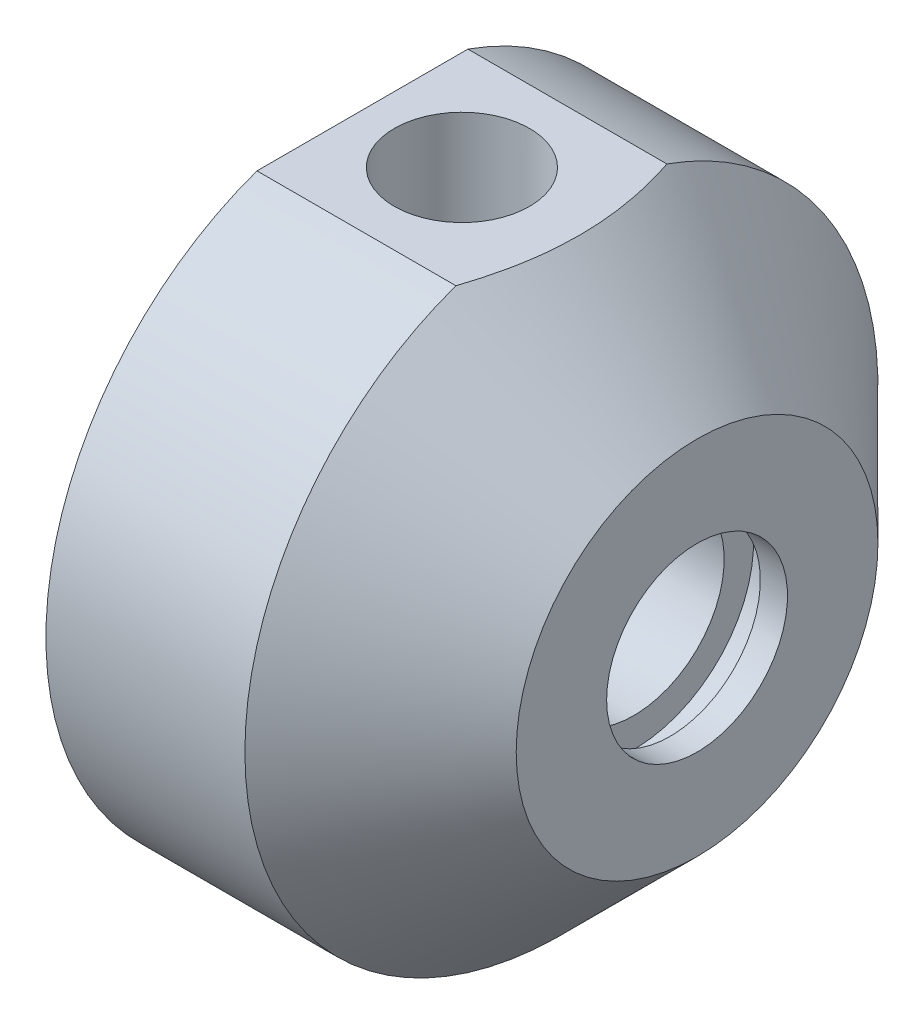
from build123d import *

# Parameters (mm, degrees)
ESQUISSE2_W                  = 51
ESQUISSE2_H                  = 6
ENL_V_MAT_EXTRU_1_DEPTH      = 25
ENL_V_MAT_EXTRU_2_REACH      = 82.777
ESQUISSE3_R                  = 7.475
ESQUISSE4_R                  = 3
ENL_V_MAT_EXTRU_3_DEPTH      = 20
R_P_TITION_CIRCULAIRE1_COUNT = 4
ESQUISSE7_R                  = 3
ENL_V_MAT_EXTRU_5_DEPTH      = 11
ENL_V_MAT_EXTRU_6_REACH      = 75.362
ESQUISSE8_R                  = 1


with BuildPart() as part:
    # Esquisse1 → Base-R_volution (revolve)
    with BuildSketch(Plane.XY, mode=Mode.PRIVATE) as base_r_volution_sk:
        Polygon((-26, 16), (-26, 20), (-23, 20), (-23, 18.5), (-20.4, 18.5), (-20.4, 20), (-16, 20), (-16, 35), (6, 35), (21, 20), (21, 10), (18, 10), (18, 13.25), (14, 13.25), (14, 10), (3.732050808, 10), (2, 13), (-23, 13), align=None)
    revolve(base_r_volution_sk.sketch.rotate(Axis((-21, 0, 0), (1, 0, 0)), 90), axis=Axis((-21, 0, 0), (1, 0, 0)))

    # Esquisse2 → Enl_v. mat.-Extru.1 (cut, symmetric)
    with BuildSketch(Plane.XY):
        with Locations((-5.5, 36)):
            Rectangle(ESQUISSE2_W, ESQUISSE2_H)
    extrude(amount=ENL_V_MAT_EXTRU_1_DEPTH, both=True, mode=Mode.SUBTRACT)

    # Esquisse3 → Enl_v. mat.-Extru.2 (cut, up to next)
    with BuildSketch(Plane(origin=(0, 33, 0), x_dir=(-1, 0, 0), z_dir=(0, 1, 0)), mode=Mode.PRIVATE) as enl_v_mat_extru_2_sk1:
        with Locations(Location((5, 0, 0), (0, 0, 90))):
            Circle(ESQUISSE3_R)
    enl_v_mat_extru_2_tool1 = extrude(enl_v_mat_extru_2_sk1.sketch, amount=-ENL_V_MAT_EXTRU_2_REACH, mode=Mode.PRIVATE) & part.part
    add(enl_v_mat_extru_2_tool1.solids().sort_by_distance((-5, 33, 0))[0], mode=Mode.SUBTRACT)

    # Esquisse4 → Enl_v. mat.-Extru.3 (cut)
    with BuildSketch(Plane.ZY.offset(16)):
        with Locations((19.798989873, -19.798989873)):
            Circle(ESQUISSE4_R)
    enl_v_mat_extru_3 = extrude(amount=-ENL_V_MAT_EXTRU_3_DEPTH, mode=Mode.SUBTRACT)

    # R_p_tition circulaire1: Enl_v. mat.-Extru.3 ×4 about axis
    r_p_tition_circulaire1_axis = Axis((-21, 0, 0), (1, 0, 0))
    for i in range(1, R_P_TITION_CIRCULAIRE1_COUNT):
        add(enl_v_mat_extru_3.rotate(r_p_tition_circulaire1_axis, i * 360 / R_P_TITION_CIRCULAIRE1_COUNT), mode=Mode.SUBTRACT)

    # Esquisse7 → Enl_v. mat.-Extru.5 (cut)
    with BuildSketch(Plane.XY.offset(-35)):
        with Locations(Location((-5, 0.349567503, 0), (0, 0, 180))):
            Circle(ESQUISSE7_R)
    extrude(amount=ENL_V_MAT_EXTRU_5_DEPTH, mode=Mode.SUBTRACT)

    # Esquisse8 → Enl_v. mat.-Extru.6 (cut, up to next)
    with BuildSketch(Plane(origin=(0, 0, -24), x_dir=(-1, 0, 0), z_dir=(0, 0, -1)), mode=Mode.PRIVATE) as enl_v_mat_extru_6_sk1:
        with Locations((5, 0.349567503)):
            Circle(ESQUISSE8_R)
    enl_v_mat_extru_6_tool1 = extrude(enl_v_mat_extru_6_sk1.sketch, amount=-ENL_V_MAT_EXTRU_6_REACH, mode=Mode.PRIVATE) & part.part
    add(enl_v_mat_extru_6_tool1.solids().sort_by_distance((-5, 0.349568, -24))[0], mode=Mode.SUBTRACT)


solid = part.part
